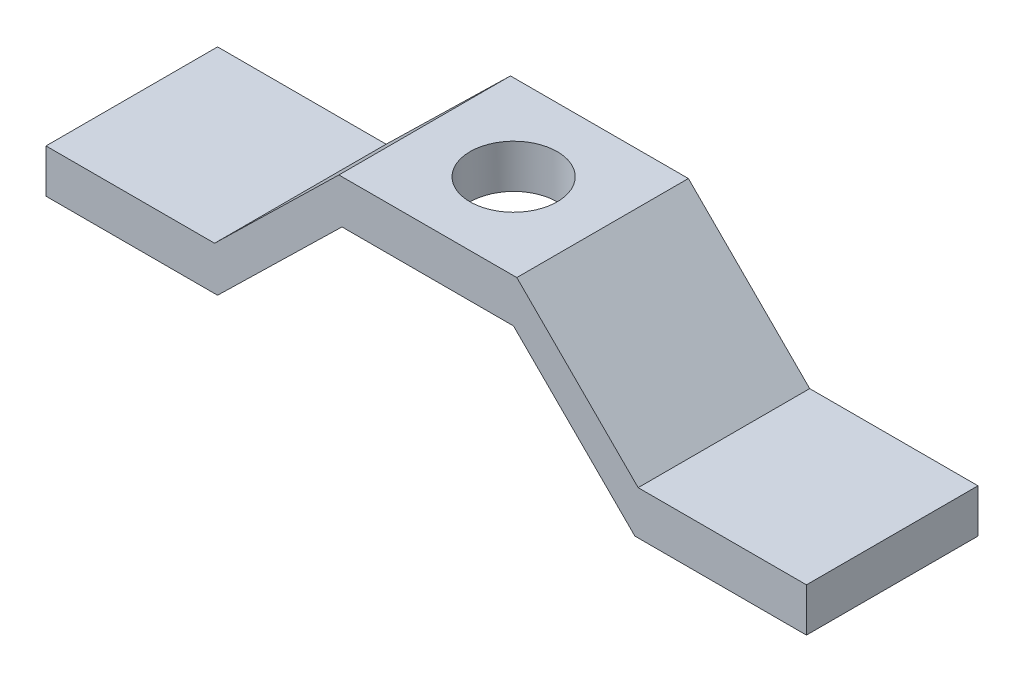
from build123d import *

# Parameters (mm, degrees)
BOSS_EXTRUDE2_DEPTH = 20
SKETCH4_R           = 5.08
CUT_EXTRUDE1_DEPTH  = 5.08


with BuildPart() as part:
    # Sketch3 → Boss-Extrude2 (new body)
    with BuildSketch(Plane.XY):
        Polygon((-65.825212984, -43.723523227), (-51.332239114, -29.583523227), (-30.589177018, -29.570613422), (-16.444906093, -43.710613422), (3.173966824, -43.710613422), (3.173966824, -48.790613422), (-16.826033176, -48.790613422), (-30.970304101, -34.650613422), (-50.970304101, -34.650613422), (-65.476510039, -48.803523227), (-85.476510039, -48.803523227), (-85.476510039, -43.723523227), align=None)
    extrude(amount=BOSS_EXTRUDE2_DEPTH)

    # Sketch4 → Cut-Extrude1 (cut)
    with BuildSketch(Plane(origin=(0.018391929, -29.55156427, 0), x_dir=(0.9999998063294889, 0.0006223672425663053, 0), z_dir=(-0.0006223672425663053, 0.999999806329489, 0))):
        with Locations(Location((-40.979107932, -10, 0), (0, 0, 180))):
            Circle(SKETCH4_R)
    extrude(amount=-CUT_EXTRUDE1_DEPTH, mode=Mode.SUBTRACT)


solid = part.part
